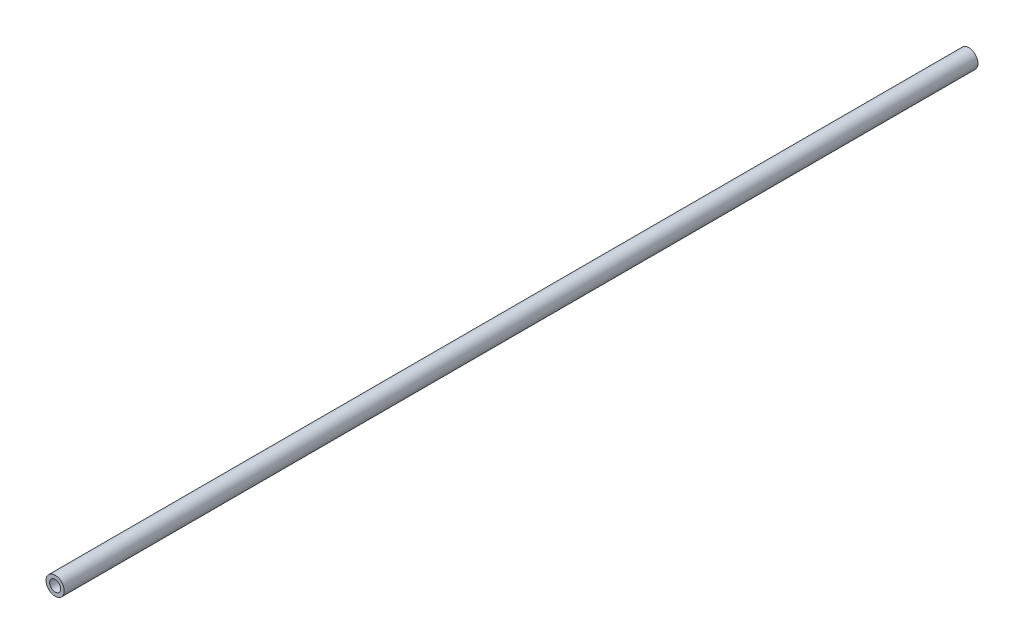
from build123d import *

# Parameters (mm, degrees)
SKETCH2_R   = 10
SKETCH2_R_2 = 6


with BuildPart() as part:
    # Sweep-Thin1: sweep along a path in Sketch1
    with BuildLine(Plane(origin=(0, 0, 0), x_dir=(0, 0, -1), z_dir=(1, 0, 0))) as sweep_thin1_path:
        Line((0, 0), (-1000, 0))
    # Sketch2 → Sweep-Thin1 (sweep)
    with BuildSketch(Plane.XY):
        Circle(SKETCH2_R)
        Circle(SKETCH2_R_2, mode=Mode.SUBTRACT)
    sweep(path=sweep_thin1_path.line)


solid = part.part
